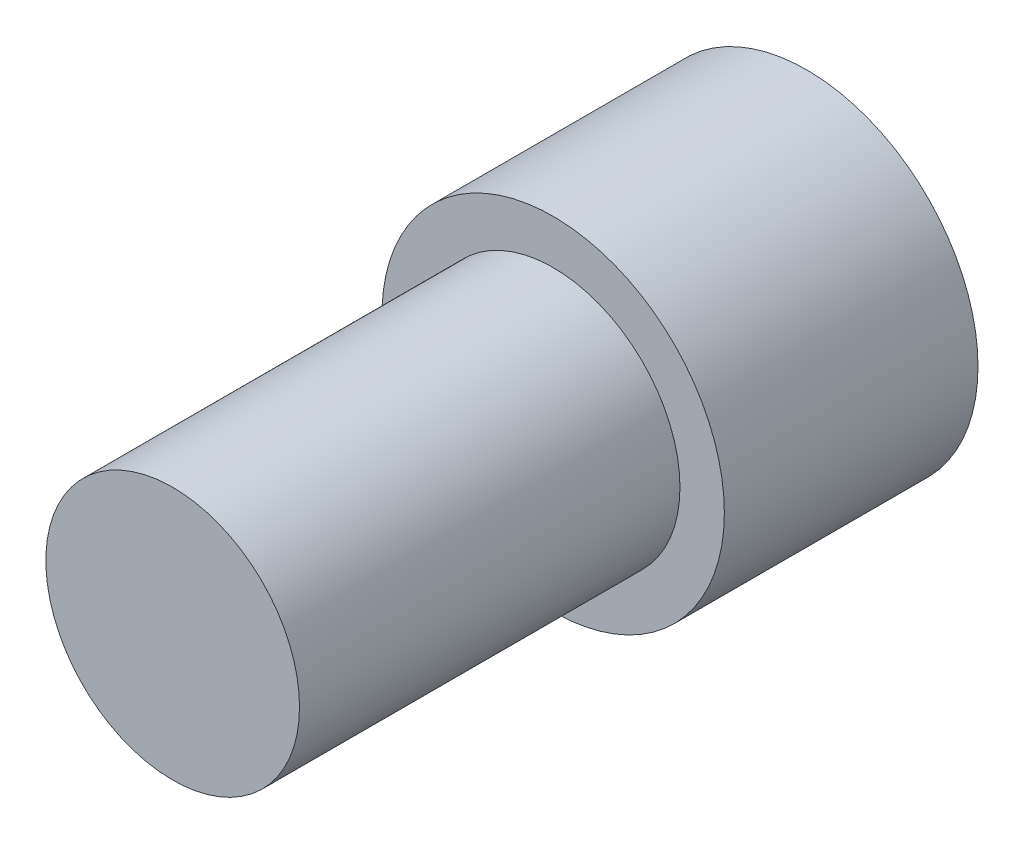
ISO-10303-21;
HEADER;
FILE_DESCRIPTION(('STEP AP214'),'2;1');
FILE_NAME('part.step','',(''),(''),'','','');
FILE_SCHEMA(('AUTOMOTIVE_DESIGN { 1 0 10303 214 1 1 1 1 }'));
ENDSEC;
DATA;
#1=APPLICATION_CONTEXT('core data for automotive mechanical design processes');
#2=APPLICATION_PROTOCOL_DEFINITION('international standard','automotive_design',2000,#1);
#3=PRODUCT_CONTEXT('',#1,'mechanical');
#4=PRODUCT('Part','Part','',(#3));
#5=PRODUCT_RELATED_PRODUCT_CATEGORY('part','',(#4));
#6=PRODUCT_DEFINITION_FORMATION('','',#4);
#7=PRODUCT_DEFINITION_CONTEXT('part definition',#1,'design');
#8=PRODUCT_DEFINITION('design','',#6,#7);
#9=PRODUCT_DEFINITION_SHAPE('','',#8);
#10=(LENGTH_UNIT() NAMED_UNIT(*) SI_UNIT(.MILLI.,.METRE.));
#11=(NAMED_UNIT(*) PLANE_ANGLE_UNIT() SI_UNIT($,.RADIAN.));
#12=(NAMED_UNIT(*) SI_UNIT($,.STERADIAN.) SOLID_ANGLE_UNIT());
#13=UNCERTAINTY_MEASURE_WITH_UNIT(LENGTH_MEASURE(1.E-05),#10,'distance_accuracy_value','');
#14=(GEOMETRIC_REPRESENTATION_CONTEXT(3) GLOBAL_UNCERTAINTY_ASSIGNED_CONTEXT((#13)) GLOBAL_UNIT_ASSIGNED_CONTEXT((#10,
#11,#12)) REPRESENTATION_CONTEXT('',''));
#15=CARTESIAN_POINT('',(0.,0.,0.));
#16=DIRECTION('',(0.,0.,1.));
#17=DIRECTION('',(1.,0.,0.));
#18=AXIS2_PLACEMENT_3D('',#15,#16,#17);
#19=CARTESIAN_POINT('',(0.,0.,20.));
#20=DIRECTION('',(0.,0.,-1.));
#21=DIRECTION('',(-1.,0.,0.));
#22=AXIS2_PLACEMENT_3D('',#19,#20,#21);
#23=CYLINDRICAL_SURFACE('',#22,13.5);
#24=CARTESIAN_POINT('',(0.,0.,20.));
#25=DIRECTION('',(0.,0.,1.));
#26=DIRECTION('',(1.,0.,0.));
#27=AXIS2_PLACEMENT_3D('',#24,#25,#26);
#28=CIRCLE('',#27,13.5);
#29=CARTESIAN_POINT('',(13.5,0.,20.));
#30=VERTEX_POINT('',#29);
#31=EDGE_CURVE('E44',#30,#30,#28,.T.);
#32=ORIENTED_EDGE('',*,*,#31,.F.);
#33=EDGE_LOOP('',(#32));
#34=FACE_BOUND('',#33,.T.);
#35=CARTESIAN_POINT('',(0.,0.,0.));
#36=DIRECTION('',(0.,0.,1.));
#37=DIRECTION('',(1.,0.,0.));
#38=AXIS2_PLACEMENT_3D('',#35,#36,#37);
#39=CIRCLE('',#38,13.5);
#40=CARTESIAN_POINT('',(13.5,0.,0.));
#41=VERTEX_POINT('',#40);
#42=EDGE_CURVE('E40',#41,#41,#39,.T.);
#43=ORIENTED_EDGE('',*,*,#42,.T.);
#44=EDGE_LOOP('',(#43));
#45=FACE_BOUND('',#44,.T.);
#46=ADVANCED_FACE('F37',(#34,#45),#23,.T.);
#47=CARTESIAN_POINT('',(0.,0.,20.));
#48=DIRECTION('',(0.,0.,1.));
#49=DIRECTION('',(1.,0.,0.));
#50=AXIS2_PLACEMENT_3D('',#47,#48,#49);
#51=PLANE('',#50);
#52=CARTESIAN_POINT('',(0.,0.,20.));
#53=DIRECTION('',(0.,0.,1.));
#54=DIRECTION('',(1.,0.,0.));
#55=AXIS2_PLACEMENT_3D('',#52,#53,#54);
#56=CIRCLE('',#55,10.);
#57=CARTESIAN_POINT('',(10.,0.,20.));
#58=VERTEX_POINT('',#57);
#59=EDGE_CURVE('E10',#58,#58,#56,.T.);
#60=ORIENTED_EDGE('',*,*,#59,.F.);
#61=EDGE_LOOP('',(#60));
#62=FACE_BOUND('',#61,.T.);
#63=ORIENTED_EDGE('',*,*,#31,.T.);
#64=EDGE_LOOP('',(#63));
#65=FACE_BOUND('',#64,.T.);
#66=ADVANCED_FACE('F61',(#62,#65),#51,.T.);
#67=CARTESIAN_POINT('',(0.,0.,0.));
#68=DIRECTION('',(0.,0.,1.));
#69=DIRECTION('',(1.,0.,0.));
#70=AXIS2_PLACEMENT_3D('',#67,#68,#69);
#71=PLANE('',#70);
#72=ORIENTED_EDGE('',*,*,#42,.F.);
#73=EDGE_LOOP('',(#72));
#74=FACE_BOUND('',#73,.T.);
#75=ADVANCED_FACE('F58',(#74),#71,.F.);
#76=CARTESIAN_POINT('',(0.,0.,50.));
#77=DIRECTION('',(0.,0.,-1.));
#78=DIRECTION('',(-1.,0.,0.));
#79=AXIS2_PLACEMENT_3D('',#76,#77,#78);
#80=CYLINDRICAL_SURFACE('',#79,10.);
#81=CARTESIAN_POINT('',(0.,0.,50.));
#82=DIRECTION('',(0.,0.,1.));
#83=DIRECTION('',(1.,0.,0.));
#84=AXIS2_PLACEMENT_3D('',#81,#82,#83);
#85=CIRCLE('',#84,10.);
#86=CARTESIAN_POINT('',(10.,0.,50.));
#87=VERTEX_POINT('',#86);
#88=EDGE_CURVE('E50',#87,#87,#85,.T.);
#89=ORIENTED_EDGE('',*,*,#88,.F.);
#90=EDGE_LOOP('',(#89));
#91=FACE_BOUND('',#90,.T.);
#92=ORIENTED_EDGE('',*,*,#59,.T.);
#93=EDGE_LOOP('',(#92));
#94=FACE_BOUND('',#93,.T.);
#95=ADVANCED_FACE('F60',(#91,#94),#80,.T.);
#96=CARTESIAN_POINT('',(0.,0.,50.));
#97=DIRECTION('',(0.,0.,1.));
#98=DIRECTION('',(1.,0.,0.));
#99=AXIS2_PLACEMENT_3D('',#96,#97,#98);
#100=PLANE('',#99);
#101=ORIENTED_EDGE('',*,*,#88,.T.);
#102=EDGE_LOOP('',(#101));
#103=FACE_BOUND('',#102,.T.);
#104=ADVANCED_FACE('F66',(#103),#100,.T.);
#105=CLOSED_SHELL('',(#46,#66,#75,#95,#104));
#106=MANIFOLD_SOLID_BREP('B2',#105);
#107=ADVANCED_BREP_SHAPE_REPRESENTATION('',(#18,#106),#14);
#108=SHAPE_DEFINITION_REPRESENTATION(#9,#107);
ENDSEC;
END-ISO-10303-21;
